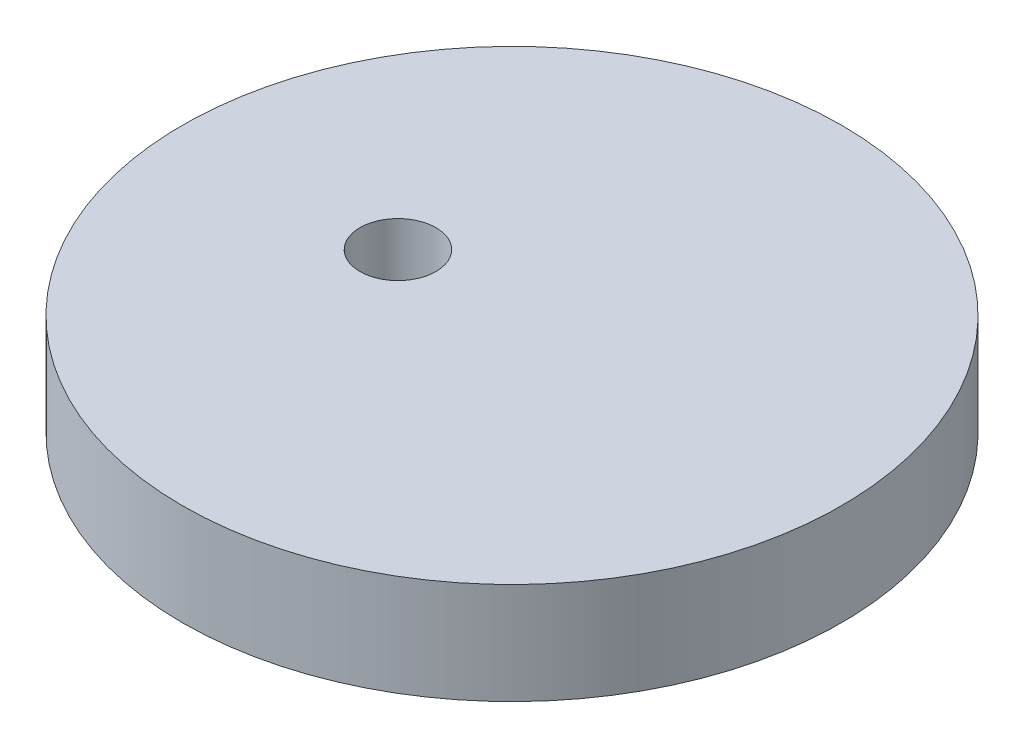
ISO-10303-21;
HEADER;
FILE_DESCRIPTION(('STEP AP214'),'2;1');
FILE_NAME('part.step','',(''),(''),'','','');
FILE_SCHEMA(('AUTOMOTIVE_DESIGN { 1 0 10303 214 1 1 1 1 }'));
ENDSEC;
DATA;
#1=APPLICATION_CONTEXT('core data for automotive mechanical design processes');
#2=APPLICATION_PROTOCOL_DEFINITION('international standard','automotive_design',2000,#1);
#3=PRODUCT_CONTEXT('',#1,'mechanical');
#4=PRODUCT('Part','Part','',(#3));
#5=PRODUCT_RELATED_PRODUCT_CATEGORY('part','',(#4));
#6=PRODUCT_DEFINITION_FORMATION('','',#4);
#7=PRODUCT_DEFINITION_CONTEXT('part definition',#1,'design');
#8=PRODUCT_DEFINITION('design','',#6,#7);
#9=PRODUCT_DEFINITION_SHAPE('','',#8);
#10=(LENGTH_UNIT() NAMED_UNIT(*) SI_UNIT(.MILLI.,.METRE.));
#11=(NAMED_UNIT(*) PLANE_ANGLE_UNIT() SI_UNIT($,.RADIAN.));
#12=(NAMED_UNIT(*) SI_UNIT($,.STERADIAN.) SOLID_ANGLE_UNIT());
#13=UNCERTAINTY_MEASURE_WITH_UNIT(LENGTH_MEASURE(1.E-05),#10,'distance_accuracy_value','');
#14=(GEOMETRIC_REPRESENTATION_CONTEXT(3) GLOBAL_UNCERTAINTY_ASSIGNED_CONTEXT((#13)) GLOBAL_UNIT_ASSIGNED_CONTEXT((#10,
#11,#12)) REPRESENTATION_CONTEXT('',''));
#15=CARTESIAN_POINT('',(0.,0.,0.));
#16=DIRECTION('',(0.,0.,1.));
#17=DIRECTION('',(1.,0.,0.));
#18=AXIS2_PLACEMENT_3D('',#15,#16,#17);
#19=CARTESIAN_POINT('',(0.,4.,0.));
#20=DIRECTION('',(0.,1.,0.));
#21=DIRECTION('',(0.,0.,1.));
#22=AXIS2_PLACEMENT_3D('',#19,#20,#21);
#23=PLANE('',#22);
#24=CARTESIAN_POINT('',(0.,4.,0.));
#25=DIRECTION('',(0.,1.,0.));
#26=DIRECTION('',(0.,0.,1.));
#27=AXIS2_PLACEMENT_3D('',#24,#25,#26);
#28=CIRCLE('',#27,13.);
#29=CARTESIAN_POINT('',(0.,4.,13.));
#30=VERTEX_POINT('',#29);
#31=EDGE_CURVE('E10',#30,#30,#28,.T.);
#32=ORIENTED_EDGE('',*,*,#31,.T.);
#33=EDGE_LOOP('',(#32));
#34=FACE_BOUND('',#33,.T.);
#35=CARTESIAN_POINT('',(-4.5,4.,0.));
#36=DIRECTION('',(0.,1.,0.));
#37=DIRECTION('',(0.,0.,1.));
#38=AXIS2_PLACEMENT_3D('',#35,#36,#37);
#39=CIRCLE('',#38,1.5);
#40=CARTESIAN_POINT('',(-4.5,4.,1.5));
#41=VERTEX_POINT('',#40);
#42=EDGE_CURVE('E42',#41,#41,#39,.T.);
#43=ORIENTED_EDGE('',*,*,#42,.F.);
#44=EDGE_LOOP('',(#43));
#45=FACE_BOUND('',#44,.T.);
#46=ADVANCED_FACE('F31',(#34,#45),#23,.T.);
#47=CARTESIAN_POINT('',(0.,0.,0.));
#48=DIRECTION('',(0.,1.,0.));
#49=DIRECTION('',(0.,0.,1.));
#50=AXIS2_PLACEMENT_3D('',#47,#48,#49);
#51=PLANE('',#50);
#52=CARTESIAN_POINT('',(0.,0.,0.));
#53=DIRECTION('',(0.,1.,0.));
#54=DIRECTION('',(0.,0.,1.));
#55=AXIS2_PLACEMENT_3D('',#52,#53,#54);
#56=CIRCLE('',#55,13.);
#57=CARTESIAN_POINT('',(0.,0.,13.));
#58=VERTEX_POINT('',#57);
#59=EDGE_CURVE('E35',#58,#58,#56,.T.);
#60=ORIENTED_EDGE('',*,*,#59,.F.);
#61=EDGE_LOOP('',(#60));
#62=FACE_BOUND('',#61,.T.);
#63=CARTESIAN_POINT('',(-4.5,0.,0.));
#64=DIRECTION('',(0.,1.,0.));
#65=DIRECTION('',(0.,0.,1.));
#66=AXIS2_PLACEMENT_3D('',#63,#64,#65);
#67=CIRCLE('',#66,1.5);
#68=CARTESIAN_POINT('',(-4.5,0.,1.5));
#69=VERTEX_POINT('',#68);
#70=EDGE_CURVE('E44',#69,#69,#67,.T.);
#71=ORIENTED_EDGE('',*,*,#70,.T.);
#72=EDGE_LOOP('',(#71));
#73=FACE_BOUND('',#72,.T.);
#74=ADVANCED_FACE('F54',(#62,#73),#51,.F.);
#75=CARTESIAN_POINT('',(0.,4.,0.));
#76=DIRECTION('',(0.,-1.,0.));
#77=DIRECTION('',(0.,0.,-1.));
#78=AXIS2_PLACEMENT_3D('',#75,#76,#77);
#79=CYLINDRICAL_SURFACE('',#78,13.);
#80=ORIENTED_EDGE('',*,*,#31,.F.);
#81=EDGE_LOOP('',(#80));
#82=FACE_BOUND('',#81,.T.);
#83=ORIENTED_EDGE('',*,*,#59,.T.);
#84=EDGE_LOOP('',(#83));
#85=FACE_BOUND('',#84,.T.);
#86=ADVANCED_FACE('F33',(#82,#85),#79,.T.);
#87=CARTESIAN_POINT('',(-4.5,4.,0.));
#88=DIRECTION('',(0.,-1.,0.));
#89=DIRECTION('',(0.,0.,-1.));
#90=AXIS2_PLACEMENT_3D('',#87,#88,#89);
#91=CYLINDRICAL_SURFACE('',#90,1.5);
#92=ORIENTED_EDGE('',*,*,#42,.T.);
#93=EDGE_LOOP('',(#92));
#94=FACE_BOUND('',#93,.T.);
#95=ORIENTED_EDGE('',*,*,#70,.F.);
#96=EDGE_LOOP('',(#95));
#97=FACE_BOUND('',#96,.T.);
#98=ADVANCED_FACE('F50',(#94,#97),#91,.F.);
#99=CLOSED_SHELL('',(#46,#74,#86,#98));
#100=MANIFOLD_SOLID_BREP('B2',#99);
#101=ADVANCED_BREP_SHAPE_REPRESENTATION('',(#18,#100),#14);
#102=SHAPE_DEFINITION_REPRESENTATION(#9,#101);
ENDSEC;
END-ISO-10303-21;
